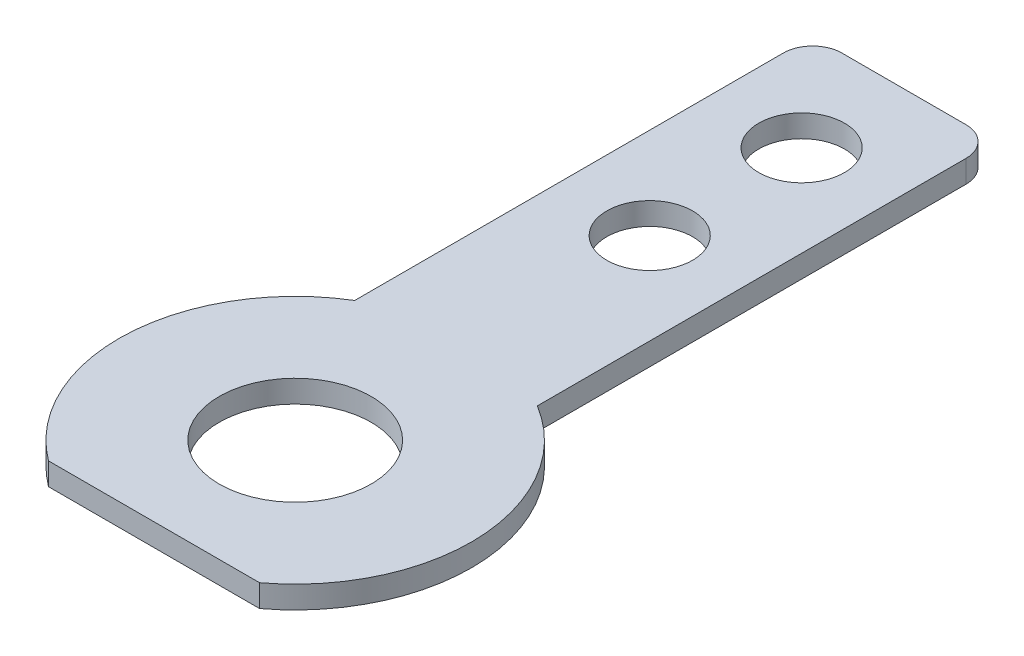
ISO-10303-21;
HEADER;
FILE_DESCRIPTION(('STEP AP214'),'2;1');
FILE_NAME('part.step','',(''),(''),'','','');
FILE_SCHEMA(('AUTOMOTIVE_DESIGN { 1 0 10303 214 1 1 1 1 }'));
ENDSEC;
DATA;
#1=APPLICATION_CONTEXT('core data for automotive mechanical design processes');
#2=APPLICATION_PROTOCOL_DEFINITION('international standard','automotive_design',2000,#1);
#3=PRODUCT_CONTEXT('',#1,'mechanical');
#4=PRODUCT('Part','Part','',(#3));
#5=PRODUCT_RELATED_PRODUCT_CATEGORY('part','',(#4));
#6=PRODUCT_DEFINITION_FORMATION('','',#4);
#7=PRODUCT_DEFINITION_CONTEXT('part definition',#1,'design');
#8=PRODUCT_DEFINITION('design','',#6,#7);
#9=PRODUCT_DEFINITION_SHAPE('','',#8);
#10=(LENGTH_UNIT() NAMED_UNIT(*) SI_UNIT(.MILLI.,.METRE.));
#11=(NAMED_UNIT(*) PLANE_ANGLE_UNIT() SI_UNIT($,.RADIAN.));
#12=(NAMED_UNIT(*) SI_UNIT($,.STERADIAN.) SOLID_ANGLE_UNIT());
#13=UNCERTAINTY_MEASURE_WITH_UNIT(LENGTH_MEASURE(1.E-05),#10,'distance_accuracy_value','');
#14=(GEOMETRIC_REPRESENTATION_CONTEXT(3) GLOBAL_UNCERTAINTY_ASSIGNED_CONTEXT((#13)) GLOBAL_UNIT_ASSIGNED_CONTEXT((#10,
#11,#12)) REPRESENTATION_CONTEXT('',''));
#15=CARTESIAN_POINT('',(0.,0.,0.));
#16=DIRECTION('',(0.,0.,1.));
#17=DIRECTION('',(1.,0.,0.));
#18=AXIS2_PLACEMENT_3D('',#15,#16,#17);
#19=CARTESIAN_POINT('',(0.,-0.5842,0.));
#20=DIRECTION('',(0.,1.,0.));
#21=DIRECTION('',(0.,0.,1.));
#22=AXIS2_PLACEMENT_3D('',#19,#20,#21);
#23=CYLINDRICAL_SURFACE('',#22,4.5974);
#24=CARTESIAN_POINT('',(0.,-0.5842,0.));
#25=DIRECTION('',(0.,1.,0.));
#26=DIRECTION('',(0.,0.,1.));
#27=AXIS2_PLACEMENT_3D('',#24,#25,#26);
#28=CIRCLE('',#27,4.5974);
#29=CARTESIAN_POINT('',(-2.38125,-0.5842,-3.9326498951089));
#30=VERTEX_POINT('',#29);
#31=CARTESIAN_POINT('',(-2.75165364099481,-0.5842,3.683));
#32=VERTEX_POINT('',#31);
#33=EDGE_CURVE('E114',#30,#32,#28,.T.);
#34=ORIENTED_EDGE('',*,*,#33,.T.);
#35=DIRECTION('',(0.,1.,0.));
#36=VECTOR('',#35,1.);
#37=CARTESIAN_POINT('',(-2.75165364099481,0.,3.683));
#38=LINE('',#37,#36);
#39=CARTESIAN_POINT('',(-2.75165364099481,0.,3.683));
#40=VERTEX_POINT('',#39);
#41=EDGE_CURVE('E99',#40,#32,#38,.F.);
#42=ORIENTED_EDGE('',*,*,#41,.F.);
#43=CARTESIAN_POINT('',(0.,0.,0.));
#44=DIRECTION('',(0.,1.,0.));
#45=DIRECTION('',(0.,0.,1.));
#46=AXIS2_PLACEMENT_3D('',#43,#44,#45);
#47=CIRCLE('',#46,4.5974);
#48=CARTESIAN_POINT('',(-2.38125,0.,-3.9326498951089));
#49=VERTEX_POINT('',#48);
#50=EDGE_CURVE('E126',#49,#40,#47,.T.);
#51=ORIENTED_EDGE('',*,*,#50,.F.);
#52=DIRECTION('',(0.,1.,0.));
#53=VECTOR('',#52,1.);
#54=CARTESIAN_POINT('',(-2.38125,-0.5842,-3.9326498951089));
#55=LINE('',#54,#53);
#56=EDGE_CURVE('E120',#30,#49,#55,.T.);
#57=ORIENTED_EDGE('',*,*,#56,.F.);
#58=EDGE_LOOP('',(#34,#42,#51,#57));
#59=FACE_BOUND('',#58,.T.);
#60=ADVANCED_FACE('F37',(#59),#23,.T.);
#61=CARTESIAN_POINT('',(2.75165364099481,0.,3.683));
#62=VERTEX_POINT('',#61);
#63=CARTESIAN_POINT('',(2.38125,0.,-3.9326498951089));
#64=VERTEX_POINT('',#63);
#65=EDGE_CURVE('E131',#62,#64,#47,.T.);
#66=ORIENTED_EDGE('',*,*,#65,.F.);
#67=DIRECTION('',(0.,1.,0.));
#68=VECTOR('',#67,1.);
#69=CARTESIAN_POINT('',(2.75165364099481,0.,3.683));
#70=LINE('',#69,#68);
#71=CARTESIAN_POINT('',(2.75165364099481,-0.5842,3.683));
#72=VERTEX_POINT('',#71);
#73=EDGE_CURVE('E52',#62,#72,#70,.F.);
#74=ORIENTED_EDGE('',*,*,#73,.T.);
#75=CARTESIAN_POINT('',(2.38125,-0.5842,-3.9326498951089));
#76=VERTEX_POINT('',#75);
#77=EDGE_CURVE('E116',#72,#76,#28,.T.);
#78=ORIENTED_EDGE('',*,*,#77,.T.);
#79=DIRECTION('',(0.,1.,0.));
#80=VECTOR('',#79,1.);
#81=CARTESIAN_POINT('',(2.38125,-0.5842,-3.9326498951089));
#82=LINE('',#81,#80);
#83=EDGE_CURVE('E157',#64,#76,#82,.F.);
#84=ORIENTED_EDGE('',*,*,#83,.F.);
#85=EDGE_LOOP('',(#66,#74,#78,#84));
#86=FACE_BOUND('',#85,.T.);
#87=ADVANCED_FACE('F194',(#86),#23,.T.);
#88=CARTESIAN_POINT('',(0.,-0.5842,0.));
#89=DIRECTION('',(0.,1.,0.));
#90=DIRECTION('',(0.,0.,1.));
#91=AXIS2_PLACEMENT_3D('',#88,#89,#90);
#92=PLANE('',#91);
#93=CARTESIAN_POINT('',(0.,-0.5842,-9.2456));
#94=DIRECTION('',(0.,1.,0.));
#95=DIRECTION('',(0.,0.,1.));
#96=AXIS2_PLACEMENT_3D('',#93,#94,#95);
#97=CIRCLE('',#96,1.1176);
#98=CARTESIAN_POINT('',(0.,-0.5842,-8.128));
#99=VERTEX_POINT('',#98);
#100=EDGE_CURVE('E305',#99,#99,#97,.T.);
#101=ORIENTED_EDGE('',*,*,#100,.T.);
#102=EDGE_LOOP('',(#101));
#103=FACE_BOUND('',#102,.T.);
#104=CARTESIAN_POINT('',(0.,-0.5842,-13.208));
#105=DIRECTION('',(0.,1.,0.));
#106=DIRECTION('',(0.,0.,1.));
#107=AXIS2_PLACEMENT_3D('',#104,#105,#106);
#108=CIRCLE('',#107,1.1176);
#109=CARTESIAN_POINT('',(0.,-0.5842,-12.0904));
#110=VERTEX_POINT('',#109);
#111=EDGE_CURVE('E312',#110,#110,#108,.T.);
#112=ORIENTED_EDGE('',*,*,#111,.T.);
#113=EDGE_LOOP('',(#112));
#114=FACE_BOUND('',#113,.T.);
#115=CARTESIAN_POINT('',(0.,-0.5842,0.));
#116=DIRECTION('',(0.,1.,0.));
#117=DIRECTION('',(0.,0.,1.));
#118=AXIS2_PLACEMENT_3D('',#115,#116,#117);
#119=CIRCLE('',#118,1.9812);
#120=CARTESIAN_POINT('',(0.,-0.5842,1.9812));
#121=VERTEX_POINT('',#120);
#122=EDGE_CURVE('E176',#121,#121,#119,.T.);
#123=ORIENTED_EDGE('',*,*,#122,.T.);
#124=EDGE_LOOP('',(#123));
#125=FACE_BOUND('',#124,.T.);
#126=DIRECTION('',(1.,0.,0.));
#127=VECTOR('',#126,1.);
#128=CARTESIAN_POINT('',(0.,-0.5842,3.683));
#129=LINE('',#128,#127);
#130=EDGE_CURVE('E102',#72,#32,#129,.F.);
#131=ORIENTED_EDGE('',*,*,#130,.T.);
#132=ORIENTED_EDGE('',*,*,#33,.F.);
#133=DIRECTION('',(0.,0.,1.));
#134=VECTOR('',#133,1.);
#135=CARTESIAN_POINT('',(-2.38125,-0.5842,-15.875));
#136=LINE('',#135,#134);
#137=CARTESIAN_POINT('',(-2.38125,-0.5842,-15.113));
#138=VERTEX_POINT('',#137);
#139=EDGE_CURVE('E175',#138,#30,#136,.T.);
#140=ORIENTED_EDGE('',*,*,#139,.F.);
#141=CARTESIAN_POINT('',(-1.61925,-0.5842,-15.113));
#142=DIRECTION('',(0.,1.,0.));
#143=DIRECTION('',(0.,0.,1.));
#144=AXIS2_PLACEMENT_3D('',#141,#142,#143);
#145=CIRCLE('',#144,0.762);
#146=CARTESIAN_POINT('',(-1.61925,-0.5842,-15.875));
#147=VERTEX_POINT('',#146);
#148=EDGE_CURVE('E141',#138,#147,#145,.F.);
#149=ORIENTED_EDGE('',*,*,#148,.T.);
#150=DIRECTION('',(-1.,0.,0.));
#151=VECTOR('',#150,1.);
#152=CARTESIAN_POINT('',(-2.38125,-0.5842,-15.875));
#153=LINE('',#152,#151);
#154=CARTESIAN_POINT('',(1.61925,-0.5842,-15.875));
#155=VERTEX_POINT('',#154);
#156=EDGE_CURVE('E147',#155,#147,#153,.T.);
#157=ORIENTED_EDGE('',*,*,#156,.F.);
#158=CARTESIAN_POINT('',(1.61925,-0.5842,-15.113));
#159=DIRECTION('',(0.,1.,0.));
#160=DIRECTION('',(0.,0.,1.));
#161=AXIS2_PLACEMENT_3D('',#158,#159,#160);
#162=CIRCLE('',#161,0.762);
#163=CARTESIAN_POINT('',(2.38125,-0.5842,-15.113));
#164=VERTEX_POINT('',#163);
#165=EDGE_CURVE('E45',#155,#164,#162,.F.);
#166=ORIENTED_EDGE('',*,*,#165,.T.);
#167=DIRECTION('',(0.,0.,-1.));
#168=VECTOR('',#167,1.);
#169=CARTESIAN_POINT('',(2.38125,-0.5842,-15.875));
#170=LINE('',#169,#168);
#171=EDGE_CURVE('E145',#76,#164,#170,.T.);
#172=ORIENTED_EDGE('',*,*,#171,.F.);
#173=ORIENTED_EDGE('',*,*,#77,.F.);
#174=EDGE_LOOP('',(#131,#132,#140,#149,#157,#166,#172,#173));
#175=FACE_BOUND('',#174,.T.);
#176=ADVANCED_FACE('F113',(#103,#114,#125,#175),#92,.F.);
#177=CARTESIAN_POINT('',(0.,0.,0.));
#178=DIRECTION('',(0.,1.,0.));
#179=DIRECTION('',(0.,0.,1.));
#180=AXIS2_PLACEMENT_3D('',#177,#178,#179);
#181=PLANE('',#180);
#182=CARTESIAN_POINT('',(0.,0.,-9.2456));
#183=DIRECTION('',(0.,1.,0.));
#184=DIRECTION('',(0.,0.,1.));
#185=AXIS2_PLACEMENT_3D('',#182,#183,#184);
#186=CIRCLE('',#185,1.1176);
#187=CARTESIAN_POINT('',(0.,0.,-8.128));
#188=VERTEX_POINT('',#187);
#189=EDGE_CURVE('E307',#188,#188,#186,.T.);
#190=ORIENTED_EDGE('',*,*,#189,.F.);
#191=EDGE_LOOP('',(#190));
#192=FACE_BOUND('',#191,.T.);
#193=CARTESIAN_POINT('',(0.,0.,-13.208));
#194=DIRECTION('',(0.,1.,0.));
#195=DIRECTION('',(0.,0.,1.));
#196=AXIS2_PLACEMENT_3D('',#193,#194,#195);
#197=CIRCLE('',#196,1.1176);
#198=CARTESIAN_POINT('',(0.,0.,-12.0904));
#199=VERTEX_POINT('',#198);
#200=EDGE_CURVE('E309',#199,#199,#197,.T.);
#201=ORIENTED_EDGE('',*,*,#200,.F.);
#202=EDGE_LOOP('',(#201));
#203=FACE_BOUND('',#202,.T.);
#204=CARTESIAN_POINT('',(0.,0.,0.));
#205=DIRECTION('',(0.,1.,0.));
#206=DIRECTION('',(0.,0.,1.));
#207=AXIS2_PLACEMENT_3D('',#204,#205,#206);
#208=CIRCLE('',#207,1.9812);
#209=CARTESIAN_POINT('',(0.,0.,1.9812));
#210=VERTEX_POINT('',#209);
#211=EDGE_CURVE('E129',#210,#210,#208,.T.);
#212=ORIENTED_EDGE('',*,*,#211,.F.);
#213=EDGE_LOOP('',(#212));
#214=FACE_BOUND('',#213,.T.);
#215=ORIENTED_EDGE('',*,*,#50,.T.);
#216=DIRECTION('',(-1.,0.,0.));
#217=VECTOR('',#216,1.);
#218=CARTESIAN_POINT('',(0.,0.,3.683));
#219=LINE('',#218,#217);
#220=EDGE_CURVE('E103',#62,#40,#219,.T.);
#221=ORIENTED_EDGE('',*,*,#220,.F.);
#222=ORIENTED_EDGE('',*,*,#65,.T.);
#223=DIRECTION('',(0.,0.,-1.));
#224=VECTOR('',#223,1.);
#225=CARTESIAN_POINT('',(2.38125,0.,-15.875));
#226=LINE('',#225,#224);
#227=CARTESIAN_POINT('',(2.38125,0.,-15.113));
#228=VERTEX_POINT('',#227);
#229=EDGE_CURVE('E108',#64,#228,#226,.T.);
#230=ORIENTED_EDGE('',*,*,#229,.T.);
#231=CARTESIAN_POINT('',(1.61925,0.,-15.113));
#232=DIRECTION('',(0.,1.,0.));
#233=DIRECTION('',(0.,0.,1.));
#234=AXIS2_PLACEMENT_3D('',#231,#232,#233);
#235=CIRCLE('',#234,0.762);
#236=CARTESIAN_POINT('',(1.61925,0.,-15.875));
#237=VERTEX_POINT('',#236);
#238=EDGE_CURVE('E134',#228,#237,#235,.T.);
#239=ORIENTED_EDGE('',*,*,#238,.T.);
#240=DIRECTION('',(-1.,0.,0.));
#241=VECTOR('',#240,1.);
#242=CARTESIAN_POINT('',(-2.38125,0.,-15.875));
#243=LINE('',#242,#241);
#244=CARTESIAN_POINT('',(-1.61925,0.,-15.875));
#245=VERTEX_POINT('',#244);
#246=EDGE_CURVE('E165',#237,#245,#243,.T.);
#247=ORIENTED_EDGE('',*,*,#246,.T.);
#248=CARTESIAN_POINT('',(-1.61925,0.,-15.113));
#249=DIRECTION('',(0.,1.,0.));
#250=DIRECTION('',(0.,0.,1.));
#251=AXIS2_PLACEMENT_3D('',#248,#249,#250);
#252=CIRCLE('',#251,0.762);
#253=CARTESIAN_POINT('',(-2.38125,0.,-15.113));
#254=VERTEX_POINT('',#253);
#255=EDGE_CURVE('E124',#245,#254,#252,.T.);
#256=ORIENTED_EDGE('',*,*,#255,.T.);
#257=DIRECTION('',(0.,0.,1.));
#258=VECTOR('',#257,1.);
#259=CARTESIAN_POINT('',(-2.38125,0.,-15.875));
#260=LINE('',#259,#258);
#261=EDGE_CURVE('E158',#254,#49,#260,.T.);
#262=ORIENTED_EDGE('',*,*,#261,.T.);
#263=EDGE_LOOP('',(#215,#221,#222,#230,#239,#247,#256,#262));
#264=FACE_BOUND('',#263,.T.);
#265=ADVANCED_FACE('F164',(#192,#203,#214,#264),#181,.T.);
#266=CARTESIAN_POINT('',(0.,-0.5842,0.));
#267=DIRECTION('',(0.,1.,0.));
#268=DIRECTION('',(0.,0.,1.));
#269=AXIS2_PLACEMENT_3D('',#266,#267,#268);
#270=CYLINDRICAL_SURFACE('',#269,1.9812);
#271=ORIENTED_EDGE('',*,*,#122,.F.);
#272=EDGE_LOOP('',(#271));
#273=FACE_BOUND('',#272,.T.);
#274=ORIENTED_EDGE('',*,*,#211,.T.);
#275=EDGE_LOOP('',(#274));
#276=FACE_BOUND('',#275,.T.);
#277=ADVANCED_FACE('F183',(#273,#276),#270,.F.);
#278=CARTESIAN_POINT('',(2.38125,-0.5842,-15.875));
#279=DIRECTION('',(1.,0.,0.));
#280=DIRECTION('',(0.,0.,-1.));
#281=AXIS2_PLACEMENT_3D('',#278,#279,#280);
#282=PLANE('',#281);
#283=ORIENTED_EDGE('',*,*,#171,.T.);
#284=DIRECTION('',(0.,1.,0.));
#285=VECTOR('',#284,1.);
#286=CARTESIAN_POINT('',(2.38125,-0.5842,-15.113));
#287=LINE('',#286,#285);
#288=EDGE_CURVE('E121',#164,#228,#287,.T.);
#289=ORIENTED_EDGE('',*,*,#288,.T.);
#290=ORIENTED_EDGE('',*,*,#229,.F.);
#291=ORIENTED_EDGE('',*,*,#83,.T.);
#292=EDGE_LOOP('',(#283,#289,#290,#291));
#293=FACE_BOUND('',#292,.T.);
#294=ADVANCED_FACE('F153',(#293),#282,.T.);
#295=CARTESIAN_POINT('',(-2.38125,-0.5842,-15.875));
#296=DIRECTION('',(-1.,0.,0.));
#297=DIRECTION('',(0.,0.,1.));
#298=AXIS2_PLACEMENT_3D('',#295,#296,#297);
#299=PLANE('',#298);
#300=ORIENTED_EDGE('',*,*,#261,.F.);
#301=DIRECTION('',(0.,1.,0.));
#302=VECTOR('',#301,1.);
#303=CARTESIAN_POINT('',(-2.38125,-0.5842,-15.113));
#304=LINE('',#303,#302);
#305=EDGE_CURVE('E11',#254,#138,#304,.F.);
#306=ORIENTED_EDGE('',*,*,#305,.T.);
#307=ORIENTED_EDGE('',*,*,#139,.T.);
#308=ORIENTED_EDGE('',*,*,#56,.T.);
#309=EDGE_LOOP('',(#300,#306,#307,#308));
#310=FACE_BOUND('',#309,.T.);
#311=ADVANCED_FACE('F211',(#310),#299,.T.);
#312=CARTESIAN_POINT('',(-2.38125,-0.5842,-15.875));
#313=DIRECTION('',(0.,0.,-1.));
#314=DIRECTION('',(-1.,0.,0.));
#315=AXIS2_PLACEMENT_3D('',#312,#313,#314);
#316=PLANE('',#315);
#317=ORIENTED_EDGE('',*,*,#246,.F.);
#318=DIRECTION('',(0.,1.,0.));
#319=VECTOR('',#318,1.);
#320=CARTESIAN_POINT('',(1.61925,-0.5842,-15.875));
#321=LINE('',#320,#319);
#322=EDGE_CURVE('E139',#237,#155,#321,.F.);
#323=ORIENTED_EDGE('',*,*,#322,.T.);
#324=ORIENTED_EDGE('',*,*,#156,.T.);
#325=DIRECTION('',(0.,1.,0.));
#326=VECTOR('',#325,1.);
#327=CARTESIAN_POINT('',(-1.61925,-0.5842,-15.875));
#328=LINE('',#327,#326);
#329=EDGE_CURVE('E136',#147,#245,#328,.T.);
#330=ORIENTED_EDGE('',*,*,#329,.T.);
#331=EDGE_LOOP('',(#317,#323,#324,#330));
#332=FACE_BOUND('',#331,.T.);
#333=ADVANCED_FACE('F167',(#332),#316,.T.);
#334=CARTESIAN_POINT('',(1.61925,-0.5842,-15.113));
#335=DIRECTION('',(0.,1.,0.));
#336=DIRECTION('',(0.,0.,1.));
#337=AXIS2_PLACEMENT_3D('',#334,#335,#336);
#338=CYLINDRICAL_SURFACE('',#337,0.762);
#339=ORIENTED_EDGE('',*,*,#165,.F.);
#340=ORIENTED_EDGE('',*,*,#322,.F.);
#341=ORIENTED_EDGE('',*,*,#238,.F.);
#342=ORIENTED_EDGE('',*,*,#288,.F.);
#343=EDGE_LOOP('',(#339,#340,#341,#342));
#344=FACE_BOUND('',#343,.T.);
#345=ADVANCED_FACE('F160',(#344),#338,.T.);
#346=CARTESIAN_POINT('',(-1.61925,-0.5842,-15.113));
#347=DIRECTION('',(0.,1.,0.));
#348=DIRECTION('',(0.,0.,1.));
#349=AXIS2_PLACEMENT_3D('',#346,#347,#348);
#350=CYLINDRICAL_SURFACE('',#349,0.762);
#351=ORIENTED_EDGE('',*,*,#148,.F.);
#352=ORIENTED_EDGE('',*,*,#305,.F.);
#353=ORIENTED_EDGE('',*,*,#255,.F.);
#354=ORIENTED_EDGE('',*,*,#329,.F.);
#355=EDGE_LOOP('',(#351,#352,#353,#354));
#356=FACE_BOUND('',#355,.T.);
#357=ADVANCED_FACE('F39',(#356),#350,.T.);
#358=CARTESIAN_POINT('',(0.,0.,3.683));
#359=DIRECTION('',(0.,0.,-1.));
#360=DIRECTION('',(-1.,0.,0.));
#361=AXIS2_PLACEMENT_3D('',#358,#359,#360);
#362=PLANE('',#361);
#363=ORIENTED_EDGE('',*,*,#220,.T.);
#364=ORIENTED_EDGE('',*,*,#41,.T.);
#365=ORIENTED_EDGE('',*,*,#130,.F.);
#366=ORIENTED_EDGE('',*,*,#73,.F.);
#367=EDGE_LOOP('',(#363,#364,#365,#366));
#368=FACE_BOUND('',#367,.T.);
#369=ADVANCED_FACE('F101',(#368),#362,.F.);
#370=CARTESIAN_POINT('',(0.,-0.5842,-13.208));
#371=DIRECTION('',(0.,1.,0.));
#372=DIRECTION('',(0.,0.,1.));
#373=AXIS2_PLACEMENT_3D('',#370,#371,#372);
#374=CYLINDRICAL_SURFACE('',#373,1.1176);
#375=ORIENTED_EDGE('',*,*,#111,.F.);
#376=EDGE_LOOP('',(#375));
#377=FACE_BOUND('',#376,.T.);
#378=ORIENTED_EDGE('',*,*,#200,.T.);
#379=EDGE_LOOP('',(#378));
#380=FACE_BOUND('',#379,.T.);
#381=ADVANCED_FACE('F266',(#377,#380),#374,.F.);
#382=CARTESIAN_POINT('',(0.,-0.5842,-9.2456));
#383=DIRECTION('',(0.,1.,0.));
#384=DIRECTION('',(0.,0.,1.));
#385=AXIS2_PLACEMENT_3D('',#382,#383,#384);
#386=CYLINDRICAL_SURFACE('',#385,1.1176);
#387=ORIENTED_EDGE('',*,*,#100,.F.);
#388=EDGE_LOOP('',(#387));
#389=FACE_BOUND('',#388,.T.);
#390=ORIENTED_EDGE('',*,*,#189,.T.);
#391=EDGE_LOOP('',(#390));
#392=FACE_BOUND('',#391,.T.);
#393=ADVANCED_FACE('F283',(#389,#392),#386,.F.);
#394=CLOSED_SHELL('',(#60,#87,#176,#265,#277,#294,#311,#333,#345,#357,#369,#381,#393));
#395=MANIFOLD_SOLID_BREP('B2',#394);
#396=ADVANCED_BREP_SHAPE_REPRESENTATION('',(#18,#395),#14);
#397=SHAPE_DEFINITION_REPRESENTATION(#9,#396);
ENDSEC;
END-ISO-10303-21;
